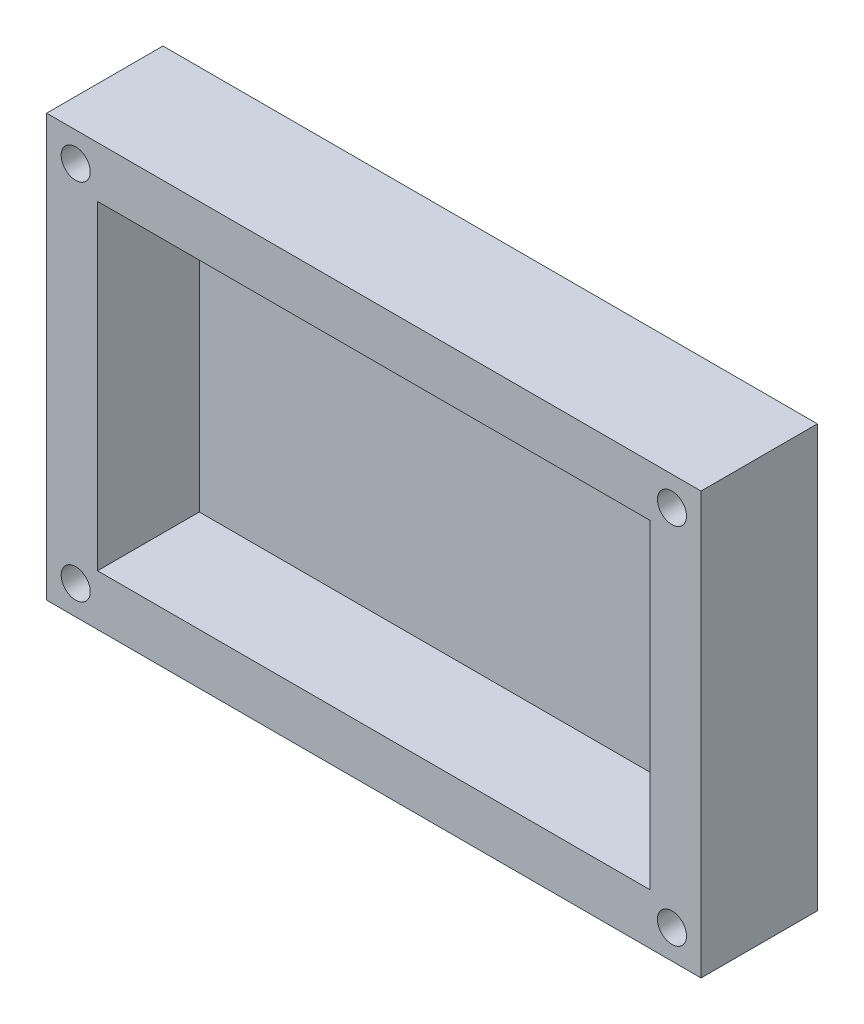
ISO-10303-21;
HEADER;
FILE_DESCRIPTION(('STEP AP214'),'2;1');
FILE_NAME('part.step','',(''),(''),'','','');
FILE_SCHEMA(('AUTOMOTIVE_DESIGN { 1 0 10303 214 1 1 1 1 }'));
ENDSEC;
DATA;
#1=APPLICATION_CONTEXT('core data for automotive mechanical design processes');
#2=APPLICATION_PROTOCOL_DEFINITION('international standard','automotive_design',2000,#1);
#3=PRODUCT_CONTEXT('',#1,'mechanical');
#4=PRODUCT('Part','Part','',(#3));
#5=PRODUCT_RELATED_PRODUCT_CATEGORY('part','',(#4));
#6=PRODUCT_DEFINITION_FORMATION('','',#4);
#7=PRODUCT_DEFINITION_CONTEXT('part definition',#1,'design');
#8=PRODUCT_DEFINITION('design','',#6,#7);
#9=PRODUCT_DEFINITION_SHAPE('','',#8);
#10=(LENGTH_UNIT() NAMED_UNIT(*) SI_UNIT(.MILLI.,.METRE.));
#11=(NAMED_UNIT(*) PLANE_ANGLE_UNIT() SI_UNIT($,.RADIAN.));
#12=(NAMED_UNIT(*) SI_UNIT($,.STERADIAN.) SOLID_ANGLE_UNIT());
#13=UNCERTAINTY_MEASURE_WITH_UNIT(LENGTH_MEASURE(1.E-05),#10,'distance_accuracy_value','');
#14=(GEOMETRIC_REPRESENTATION_CONTEXT(3) GLOBAL_UNCERTAINTY_ASSIGNED_CONTEXT((#13)) GLOBAL_UNIT_ASSIGNED_CONTEXT((#10,
#11,#12)) REPRESENTATION_CONTEXT('',''));
#15=CARTESIAN_POINT('',(0.,0.,0.));
#16=DIRECTION('',(0.,0.,1.));
#17=DIRECTION('',(1.,0.,0.));
#18=AXIS2_PLACEMENT_3D('',#15,#16,#17);
#19=CARTESIAN_POINT('',(22.5,-14.5,8.));
#20=DIRECTION('',(-1.,0.,0.));
#21=DIRECTION('',(0.,0.,1.));
#22=AXIS2_PLACEMENT_3D('',#19,#20,#21);
#23=PLANE('',#22);
#24=DIRECTION('',(0.,1.,0.));
#25=VECTOR('',#24,1.);
#26=CARTESIAN_POINT('',(22.5,-14.5,0.));
#27=LINE('',#26,#25);
#28=CARTESIAN_POINT('',(22.5,-14.5,0.));
#29=VERTEX_POINT('',#28);
#30=CARTESIAN_POINT('',(22.5,14.5,0.));
#31=VERTEX_POINT('',#30);
#32=EDGE_CURVE('E168',#29,#31,#27,.T.);
#33=ORIENTED_EDGE('',*,*,#32,.T.);
#34=DIRECTION('',(0.,0.,-1.));
#35=VECTOR('',#34,1.);
#36=CARTESIAN_POINT('',(22.5,14.5,8.));
#37=LINE('',#36,#35);
#38=CARTESIAN_POINT('',(22.5,14.5,8.));
#39=VERTEX_POINT('',#38);
#40=EDGE_CURVE('E11',#39,#31,#37,.T.);
#41=ORIENTED_EDGE('',*,*,#40,.F.);
#42=DIRECTION('',(0.,1.,0.));
#43=VECTOR('',#42,1.);
#44=CARTESIAN_POINT('',(22.5,-14.5,8.));
#45=LINE('',#44,#43);
#46=CARTESIAN_POINT('',(22.5,-14.5,8.));
#47=VERTEX_POINT('',#46);
#48=EDGE_CURVE('E174',#47,#39,#45,.T.);
#49=ORIENTED_EDGE('',*,*,#48,.F.);
#50=DIRECTION('',(0.,0.,-1.));
#51=VECTOR('',#50,1.);
#52=CARTESIAN_POINT('',(22.5,-14.5,8.));
#53=LINE('',#52,#51);
#54=EDGE_CURVE('E184',#47,#29,#53,.T.);
#55=ORIENTED_EDGE('',*,*,#54,.T.);
#56=EDGE_LOOP('',(#33,#41,#49,#55));
#57=FACE_BOUND('',#56,.T.);
#58=ADVANCED_FACE('F45',(#57),#23,.F.);
#59=CARTESIAN_POINT('',(-22.5,14.5,8.));
#60=DIRECTION('',(0.,-1.,0.));
#61=DIRECTION('',(0.,0.,-1.));
#62=AXIS2_PLACEMENT_3D('',#59,#60,#61);
#63=PLANE('',#62);
#64=DIRECTION('',(-1.,0.,0.));
#65=VECTOR('',#64,1.);
#66=CARTESIAN_POINT('',(-22.5,14.5,0.));
#67=LINE('',#66,#65);
#68=CARTESIAN_POINT('',(-22.5,14.5,0.));
#69=VERTEX_POINT('',#68);
#70=EDGE_CURVE('E188',#31,#69,#67,.T.);
#71=ORIENTED_EDGE('',*,*,#70,.T.);
#72=DIRECTION('',(0.,0.,-1.));
#73=VECTOR('',#72,1.);
#74=CARTESIAN_POINT('',(-22.5,14.5,8.));
#75=LINE('',#74,#73);
#76=CARTESIAN_POINT('',(-22.5,14.5,8.));
#77=VERTEX_POINT('',#76);
#78=EDGE_CURVE('E53',#77,#69,#75,.T.);
#79=ORIENTED_EDGE('',*,*,#78,.F.);
#80=DIRECTION('',(-1.,0.,0.));
#81=VECTOR('',#80,1.);
#82=CARTESIAN_POINT('',(-22.5,14.5,8.));
#83=LINE('',#82,#81);
#84=EDGE_CURVE('E97',#39,#77,#83,.T.);
#85=ORIENTED_EDGE('',*,*,#84,.F.);
#86=ORIENTED_EDGE('',*,*,#40,.T.);
#87=EDGE_LOOP('',(#71,#79,#85,#86));
#88=FACE_BOUND('',#87,.T.);
#89=ADVANCED_FACE('F224',(#88),#63,.F.);
#90=CARTESIAN_POINT('',(-22.5,-14.5,8.));
#91=DIRECTION('',(1.,0.,0.));
#92=DIRECTION('',(0.,0.,-1.));
#93=AXIS2_PLACEMENT_3D('',#90,#91,#92);
#94=PLANE('',#93);
#95=DIRECTION('',(0.,-1.,0.));
#96=VECTOR('',#95,1.);
#97=CARTESIAN_POINT('',(-22.5,-14.5,0.));
#98=LINE('',#97,#96);
#99=CARTESIAN_POINT('',(-22.5,-14.5,0.));
#100=VERTEX_POINT('',#99);
#101=EDGE_CURVE('E191',#69,#100,#98,.T.);
#102=ORIENTED_EDGE('',*,*,#101,.T.);
#103=DIRECTION('',(0.,0.,-1.));
#104=VECTOR('',#103,1.);
#105=CARTESIAN_POINT('',(-22.5,-14.5,8.));
#106=LINE('',#105,#104);
#107=CARTESIAN_POINT('',(-22.5,-14.5,8.));
#108=VERTEX_POINT('',#107);
#109=EDGE_CURVE('E198',#108,#100,#106,.T.);
#110=ORIENTED_EDGE('',*,*,#109,.F.);
#111=DIRECTION('',(0.,-1.,0.));
#112=VECTOR('',#111,1.);
#113=CARTESIAN_POINT('',(-22.5,-14.5,8.));
#114=LINE('',#113,#112);
#115=EDGE_CURVE('E179',#77,#108,#114,.T.);
#116=ORIENTED_EDGE('',*,*,#115,.F.);
#117=ORIENTED_EDGE('',*,*,#78,.T.);
#118=EDGE_LOOP('',(#102,#110,#116,#117));
#119=FACE_BOUND('',#118,.T.);
#120=ADVANCED_FACE('F205',(#119),#94,.F.);
#121=CARTESIAN_POINT('',(-22.5,-14.5,8.));
#122=DIRECTION('',(0.,1.,0.));
#123=DIRECTION('',(0.,0.,1.));
#124=AXIS2_PLACEMENT_3D('',#121,#122,#123);
#125=PLANE('',#124);
#126=DIRECTION('',(1.,0.,0.));
#127=VECTOR('',#126,1.);
#128=CARTESIAN_POINT('',(-22.5,-14.5,0.));
#129=LINE('',#128,#127);
#130=EDGE_CURVE('E90',#100,#29,#129,.T.);
#131=ORIENTED_EDGE('',*,*,#130,.T.);
#132=ORIENTED_EDGE('',*,*,#54,.F.);
#133=DIRECTION('',(1.,0.,0.));
#134=VECTOR('',#133,1.);
#135=CARTESIAN_POINT('',(-22.5,-14.5,8.));
#136=LINE('',#135,#134);
#137=EDGE_CURVE('E69',#108,#47,#136,.T.);
#138=ORIENTED_EDGE('',*,*,#137,.F.);
#139=ORIENTED_EDGE('',*,*,#109,.T.);
#140=EDGE_LOOP('',(#131,#132,#138,#139));
#141=FACE_BOUND('',#140,.T.);
#142=ADVANCED_FACE('F213',(#141),#125,.F.);
#143=CARTESIAN_POINT('',(0.,0.,8.));
#144=DIRECTION('',(0.,0.,-1.));
#145=DIRECTION('',(-1.,0.,0.));
#146=AXIS2_PLACEMENT_3D('',#143,#144,#145);
#147=PLANE('',#146);
#148=CARTESIAN_POINT('',(-20.5,-12.5,8.));
#149=DIRECTION('',(0.,0.,1.));
#150=DIRECTION('',(1.,0.,0.));
#151=AXIS2_PLACEMENT_3D('',#148,#149,#150);
#152=CIRCLE('',#151,1.);
#153=CARTESIAN_POINT('',(-19.5,-12.5,8.));
#154=VERTEX_POINT('',#153);
#155=EDGE_CURVE('E386',#154,#154,#152,.T.);
#156=ORIENTED_EDGE('',*,*,#155,.F.);
#157=EDGE_LOOP('',(#156));
#158=FACE_BOUND('',#157,.T.);
#159=CARTESIAN_POINT('',(20.5,12.5,8.));
#160=DIRECTION('',(0.,0.,1.));
#161=DIRECTION('',(1.,0.,0.));
#162=AXIS2_PLACEMENT_3D('',#159,#160,#161);
#163=CIRCLE('',#162,1.);
#164=CARTESIAN_POINT('',(21.5,12.5,8.));
#165=VERTEX_POINT('',#164);
#166=EDGE_CURVE('E387',#165,#165,#163,.T.);
#167=ORIENTED_EDGE('',*,*,#166,.F.);
#168=EDGE_LOOP('',(#167));
#169=FACE_BOUND('',#168,.T.);
#170=CARTESIAN_POINT('',(20.5,-12.5,8.));
#171=DIRECTION('',(0.,0.,1.));
#172=DIRECTION('',(1.,0.,0.));
#173=AXIS2_PLACEMENT_3D('',#170,#171,#172);
#174=CIRCLE('',#173,1.);
#175=CARTESIAN_POINT('',(21.5,-12.5,8.));
#176=VERTEX_POINT('',#175);
#177=EDGE_CURVE('E400',#176,#176,#174,.T.);
#178=ORIENTED_EDGE('',*,*,#177,.F.);
#179=EDGE_LOOP('',(#178));
#180=FACE_BOUND('',#179,.T.);
#181=CARTESIAN_POINT('',(-20.5,12.5,8.));
#182=DIRECTION('',(0.,0.,1.));
#183=DIRECTION('',(1.,0.,0.));
#184=AXIS2_PLACEMENT_3D('',#181,#182,#183);
#185=CIRCLE('',#184,1.);
#186=CARTESIAN_POINT('',(-19.5,12.5,8.));
#187=VERTEX_POINT('',#186);
#188=EDGE_CURVE('E149',#187,#187,#185,.T.);
#189=ORIENTED_EDGE('',*,*,#188,.F.);
#190=EDGE_LOOP('',(#189));
#191=FACE_BOUND('',#190,.T.);
#192=DIRECTION('',(-1.,0.,0.));
#193=VECTOR('',#192,1.);
#194=CARTESIAN_POINT('',(-19.,11.,8.));
#195=LINE('',#194,#193);
#196=CARTESIAN_POINT('',(19.,11.,8.));
#197=VERTEX_POINT('',#196);
#198=CARTESIAN_POINT('',(-19.,11.,8.));
#199=VERTEX_POINT('',#198);
#200=EDGE_CURVE('E158',#197,#199,#195,.T.);
#201=ORIENTED_EDGE('',*,*,#200,.F.);
#202=DIRECTION('',(0.,1.,0.));
#203=VECTOR('',#202,1.);
#204=CARTESIAN_POINT('',(19.,-11.,8.));
#205=LINE('',#204,#203);
#206=CARTESIAN_POINT('',(19.,-11.,8.));
#207=VERTEX_POINT('',#206);
#208=EDGE_CURVE('E60',#207,#197,#205,.T.);
#209=ORIENTED_EDGE('',*,*,#208,.F.);
#210=DIRECTION('',(1.,0.,0.));
#211=VECTOR('',#210,1.);
#212=CARTESIAN_POINT('',(-19.,-11.,8.));
#213=LINE('',#212,#211);
#214=CARTESIAN_POINT('',(-19.,-11.,8.));
#215=VERTEX_POINT('',#214);
#216=EDGE_CURVE('E142',#215,#207,#213,.T.);
#217=ORIENTED_EDGE('',*,*,#216,.F.);
#218=DIRECTION('',(0.,-1.,0.));
#219=VECTOR('',#218,1.);
#220=CARTESIAN_POINT('',(-19.,-11.,8.));
#221=LINE('',#220,#219);
#222=EDGE_CURVE('E146',#199,#215,#221,.T.);
#223=ORIENTED_EDGE('',*,*,#222,.F.);
#224=EDGE_LOOP('',(#201,#209,#217,#223));
#225=FACE_BOUND('',#224,.T.);
#226=ORIENTED_EDGE('',*,*,#48,.T.);
#227=ORIENTED_EDGE('',*,*,#84,.T.);
#228=ORIENTED_EDGE('',*,*,#115,.T.);
#229=ORIENTED_EDGE('',*,*,#137,.T.);
#230=EDGE_LOOP('',(#226,#227,#228,#229));
#231=FACE_BOUND('',#230,.T.);
#232=ADVANCED_FACE('F215',(#158,#169,#180,#191,#225,#231),#147,.F.);
#233=CARTESIAN_POINT('',(0.,0.,0.));
#234=DIRECTION('',(0.,0.,-1.));
#235=DIRECTION('',(-1.,0.,0.));
#236=AXIS2_PLACEMENT_3D('',#233,#234,#235);
#237=PLANE('',#236);
#238=ORIENTED_EDGE('',*,*,#32,.F.);
#239=ORIENTED_EDGE('',*,*,#130,.F.);
#240=ORIENTED_EDGE('',*,*,#101,.F.);
#241=ORIENTED_EDGE('',*,*,#70,.F.);
#242=EDGE_LOOP('',(#238,#239,#240,#241));
#243=FACE_BOUND('',#242,.T.);
#244=ADVANCED_FACE('F209',(#243),#237,.T.);
#245=CARTESIAN_POINT('',(19.,-11.,1.));
#246=DIRECTION('',(1.,0.,0.));
#247=DIRECTION('',(0.,0.,-1.));
#248=AXIS2_PLACEMENT_3D('',#245,#246,#247);
#249=PLANE('',#248);
#250=ORIENTED_EDGE('',*,*,#208,.T.);
#251=DIRECTION('',(0.,0.,1.));
#252=VECTOR('',#251,1.);
#253=CARTESIAN_POINT('',(19.,11.,1.));
#254=LINE('',#253,#252);
#255=CARTESIAN_POINT('',(19.,11.,1.));
#256=VERTEX_POINT('',#255);
#257=EDGE_CURVE('E117',#256,#197,#254,.T.);
#258=ORIENTED_EDGE('',*,*,#257,.F.);
#259=DIRECTION('',(0.,1.,0.));
#260=VECTOR('',#259,1.);
#261=CARTESIAN_POINT('',(19.,-11.,1.));
#262=LINE('',#261,#260);
#263=CARTESIAN_POINT('',(19.,-11.,1.));
#264=VERTEX_POINT('',#263);
#265=EDGE_CURVE('E121',#264,#256,#262,.T.);
#266=ORIENTED_EDGE('',*,*,#265,.F.);
#267=DIRECTION('',(0.,0.,1.));
#268=VECTOR('',#267,1.);
#269=CARTESIAN_POINT('',(19.,-11.,1.));
#270=LINE('',#269,#268);
#271=EDGE_CURVE('E165',#264,#207,#270,.T.);
#272=ORIENTED_EDGE('',*,*,#271,.T.);
#273=EDGE_LOOP('',(#250,#258,#266,#272));
#274=FACE_BOUND('',#273,.T.);
#275=ADVANCED_FACE('F119',(#274),#249,.F.);
#276=CARTESIAN_POINT('',(-19.,-11.,1.));
#277=DIRECTION('',(0.,-1.,0.));
#278=DIRECTION('',(0.,0.,-1.));
#279=AXIS2_PLACEMENT_3D('',#276,#277,#278);
#280=PLANE('',#279);
#281=ORIENTED_EDGE('',*,*,#216,.T.);
#282=ORIENTED_EDGE('',*,*,#271,.F.);
#283=DIRECTION('',(1.,0.,0.));
#284=VECTOR('',#283,1.);
#285=CARTESIAN_POINT('',(-19.,-11.,1.));
#286=LINE('',#285,#284);
#287=CARTESIAN_POINT('',(-19.,-11.,1.));
#288=VERTEX_POINT('',#287);
#289=EDGE_CURVE('E128',#288,#264,#286,.T.);
#290=ORIENTED_EDGE('',*,*,#289,.F.);
#291=DIRECTION('',(0.,0.,1.));
#292=VECTOR('',#291,1.);
#293=CARTESIAN_POINT('',(-19.,-11.,1.));
#294=LINE('',#293,#292);
#295=EDGE_CURVE('E169',#288,#215,#294,.T.);
#296=ORIENTED_EDGE('',*,*,#295,.T.);
#297=EDGE_LOOP('',(#281,#282,#290,#296));
#298=FACE_BOUND('',#297,.T.);
#299=ADVANCED_FACE('F266',(#298),#280,.F.);
#300=CARTESIAN_POINT('',(-19.,-11.,1.));
#301=DIRECTION('',(-1.,0.,0.));
#302=DIRECTION('',(0.,0.,1.));
#303=AXIS2_PLACEMENT_3D('',#300,#301,#302);
#304=PLANE('',#303);
#305=ORIENTED_EDGE('',*,*,#222,.T.);
#306=ORIENTED_EDGE('',*,*,#295,.F.);
#307=DIRECTION('',(0.,-1.,0.));
#308=VECTOR('',#307,1.);
#309=CARTESIAN_POINT('',(-19.,-11.,1.));
#310=LINE('',#309,#308);
#311=CARTESIAN_POINT('',(-19.,11.,1.));
#312=VERTEX_POINT('',#311);
#313=EDGE_CURVE('E137',#312,#288,#310,.T.);
#314=ORIENTED_EDGE('',*,*,#313,.F.);
#315=DIRECTION('',(0.,0.,1.));
#316=VECTOR('',#315,1.);
#317=CARTESIAN_POINT('',(-19.,11.,1.));
#318=LINE('',#317,#316);
#319=EDGE_CURVE('E127',#312,#199,#318,.T.);
#320=ORIENTED_EDGE('',*,*,#319,.T.);
#321=EDGE_LOOP('',(#305,#306,#314,#320));
#322=FACE_BOUND('',#321,.T.);
#323=ADVANCED_FACE('F275',(#322),#304,.F.);
#324=CARTESIAN_POINT('',(-19.,11.,1.));
#325=DIRECTION('',(0.,1.,0.));
#326=DIRECTION('',(0.,0.,1.));
#327=AXIS2_PLACEMENT_3D('',#324,#325,#326);
#328=PLANE('',#327);
#329=ORIENTED_EDGE('',*,*,#200,.T.);
#330=ORIENTED_EDGE('',*,*,#319,.F.);
#331=DIRECTION('',(-1.,0.,0.));
#332=VECTOR('',#331,1.);
#333=CARTESIAN_POINT('',(-19.,11.,1.));
#334=LINE('',#333,#332);
#335=EDGE_CURVE('E131',#256,#312,#334,.T.);
#336=ORIENTED_EDGE('',*,*,#335,.F.);
#337=ORIENTED_EDGE('',*,*,#257,.T.);
#338=EDGE_LOOP('',(#329,#330,#336,#337));
#339=FACE_BOUND('',#338,.T.);
#340=ADVANCED_FACE('F132',(#339),#328,.F.);
#341=CARTESIAN_POINT('',(0.,0.,1.));
#342=DIRECTION('',(0.,0.,-1.));
#343=DIRECTION('',(-1.,0.,0.));
#344=AXIS2_PLACEMENT_3D('',#341,#342,#343);
#345=PLANE('',#344);
#346=ORIENTED_EDGE('',*,*,#265,.T.);
#347=ORIENTED_EDGE('',*,*,#335,.T.);
#348=ORIENTED_EDGE('',*,*,#313,.T.);
#349=ORIENTED_EDGE('',*,*,#289,.T.);
#350=EDGE_LOOP('',(#346,#347,#348,#349));
#351=FACE_BOUND('',#350,.T.);
#352=ADVANCED_FACE('F139',(#351),#345,.F.);
#353=CARTESIAN_POINT('',(-20.5,12.5,1.));
#354=DIRECTION('',(0.,0.,1.));
#355=DIRECTION('',(1.,0.,0.));
#356=AXIS2_PLACEMENT_3D('',#353,#354,#355);
#357=CYLINDRICAL_SURFACE('',#356,1.);
#358=CARTESIAN_POINT('',(-20.5,12.5,1.));
#359=DIRECTION('',(0.,0.,1.));
#360=DIRECTION('',(1.,0.,0.));
#361=AXIS2_PLACEMENT_3D('',#358,#359,#360);
#362=CIRCLE('',#361,1.);
#363=CARTESIAN_POINT('',(-19.5,12.5,1.));
#364=VERTEX_POINT('',#363);
#365=EDGE_CURVE('E159',#364,#364,#362,.T.);
#366=ORIENTED_EDGE('',*,*,#365,.F.);
#367=EDGE_LOOP('',(#366));
#368=FACE_BOUND('',#367,.T.);
#369=ORIENTED_EDGE('',*,*,#188,.T.);
#370=EDGE_LOOP('',(#369));
#371=FACE_BOUND('',#370,.T.);
#372=ADVANCED_FACE('F301',(#368,#371),#357,.F.);
#373=CARTESIAN_POINT('',(-20.5,12.5,1.));
#374=DIRECTION('',(0.,0.,1.));
#375=DIRECTION('',(1.,0.,0.));
#376=AXIS2_PLACEMENT_3D('',#373,#374,#375);
#377=PLANE('',#376);
#378=ORIENTED_EDGE('',*,*,#365,.T.);
#379=EDGE_LOOP('',(#378));
#380=FACE_BOUND('',#379,.T.);
#381=ADVANCED_FACE('F309',(#380),#377,.T.);
#382=CARTESIAN_POINT('',(20.5,-12.5,1.));
#383=DIRECTION('',(0.,0.,1.));
#384=DIRECTION('',(1.,0.,0.));
#385=AXIS2_PLACEMENT_3D('',#382,#383,#384);
#386=CYLINDRICAL_SURFACE('',#385,1.);
#387=CARTESIAN_POINT('',(20.5,-12.5,1.));
#388=DIRECTION('',(0.,0.,1.));
#389=DIRECTION('',(1.,0.,0.));
#390=AXIS2_PLACEMENT_3D('',#387,#388,#389);
#391=CIRCLE('',#390,1.);
#392=CARTESIAN_POINT('',(21.5,-12.5,1.));
#393=VERTEX_POINT('',#392);
#394=EDGE_CURVE('E415',#393,#393,#391,.T.);
#395=ORIENTED_EDGE('',*,*,#394,.F.);
#396=EDGE_LOOP('',(#395));
#397=FACE_BOUND('',#396,.T.);
#398=ORIENTED_EDGE('',*,*,#177,.T.);
#399=EDGE_LOOP('',(#398));
#400=FACE_BOUND('',#399,.T.);
#401=ADVANCED_FACE('F319',(#397,#400),#386,.F.);
#402=CARTESIAN_POINT('',(20.5,-12.5,1.));
#403=DIRECTION('',(0.,0.,1.));
#404=DIRECTION('',(1.,0.,0.));
#405=AXIS2_PLACEMENT_3D('',#402,#403,#404);
#406=PLANE('',#405);
#407=ORIENTED_EDGE('',*,*,#394,.T.);
#408=EDGE_LOOP('',(#407));
#409=FACE_BOUND('',#408,.T.);
#410=ADVANCED_FACE('F329',(#409),#406,.T.);
#411=CARTESIAN_POINT('',(20.5,12.5,1.));
#412=DIRECTION('',(0.,0.,1.));
#413=DIRECTION('',(1.,0.,0.));
#414=AXIS2_PLACEMENT_3D('',#411,#412,#413);
#415=CYLINDRICAL_SURFACE('',#414,1.);
#416=CARTESIAN_POINT('',(20.5,12.5,1.));
#417=DIRECTION('',(0.,0.,1.));
#418=DIRECTION('',(1.,0.,0.));
#419=AXIS2_PLACEMENT_3D('',#416,#417,#418);
#420=CIRCLE('',#419,1.);
#421=CARTESIAN_POINT('',(21.5,12.5,1.));
#422=VERTEX_POINT('',#421);
#423=EDGE_CURVE('E394',#422,#422,#420,.T.);
#424=ORIENTED_EDGE('',*,*,#423,.F.);
#425=EDGE_LOOP('',(#424));
#426=FACE_BOUND('',#425,.T.);
#427=ORIENTED_EDGE('',*,*,#166,.T.);
#428=EDGE_LOOP('',(#427));
#429=FACE_BOUND('',#428,.T.);
#430=ADVANCED_FACE('F339',(#426,#429),#415,.F.);
#431=CARTESIAN_POINT('',(20.5,12.5,1.));
#432=DIRECTION('',(0.,0.,1.));
#433=DIRECTION('',(1.,0.,0.));
#434=AXIS2_PLACEMENT_3D('',#431,#432,#433);
#435=PLANE('',#434);
#436=ORIENTED_EDGE('',*,*,#423,.T.);
#437=EDGE_LOOP('',(#436));
#438=FACE_BOUND('',#437,.T.);
#439=ADVANCED_FACE('F349',(#438),#435,.T.);
#440=CARTESIAN_POINT('',(-20.5,-12.5,1.));
#441=DIRECTION('',(0.,0.,1.));
#442=DIRECTION('',(1.,0.,0.));
#443=AXIS2_PLACEMENT_3D('',#440,#441,#442);
#444=CYLINDRICAL_SURFACE('',#443,1.);
#445=CARTESIAN_POINT('',(-20.5,-12.5,1.));
#446=DIRECTION('',(0.,0.,1.));
#447=DIRECTION('',(1.,0.,0.));
#448=AXIS2_PLACEMENT_3D('',#445,#446,#447);
#449=CIRCLE('',#448,1.);
#450=CARTESIAN_POINT('',(-19.5,-12.5,1.));
#451=VERTEX_POINT('',#450);
#452=EDGE_CURVE('E384',#451,#451,#449,.T.);
#453=ORIENTED_EDGE('',*,*,#452,.F.);
#454=EDGE_LOOP('',(#453));
#455=FACE_BOUND('',#454,.T.);
#456=ORIENTED_EDGE('',*,*,#155,.T.);
#457=EDGE_LOOP('',(#456));
#458=FACE_BOUND('',#457,.T.);
#459=ADVANCED_FACE('F359',(#455,#458),#444,.F.);
#460=CARTESIAN_POINT('',(-20.5,-12.5,1.));
#461=DIRECTION('',(0.,0.,1.));
#462=DIRECTION('',(1.,0.,0.));
#463=AXIS2_PLACEMENT_3D('',#460,#461,#462);
#464=PLANE('',#463);
#465=ORIENTED_EDGE('',*,*,#452,.T.);
#466=EDGE_LOOP('',(#465));
#467=FACE_BOUND('',#466,.T.);
#468=ADVANCED_FACE('F369',(#467),#464,.T.);
#469=CLOSED_SHELL('',(#58,#89,#120,#142,#232,#244,#275,#299,#323,#340,#352,#372,#381,#401,#410,
#430,#439,#459,#468));
#470=MANIFOLD_SOLID_BREP('B2',#469);
#471=ADVANCED_BREP_SHAPE_REPRESENTATION('',(#18,#470),#14);
#472=SHAPE_DEFINITION_REPRESENTATION(#9,#471);
ENDSEC;
END-ISO-10303-21;
